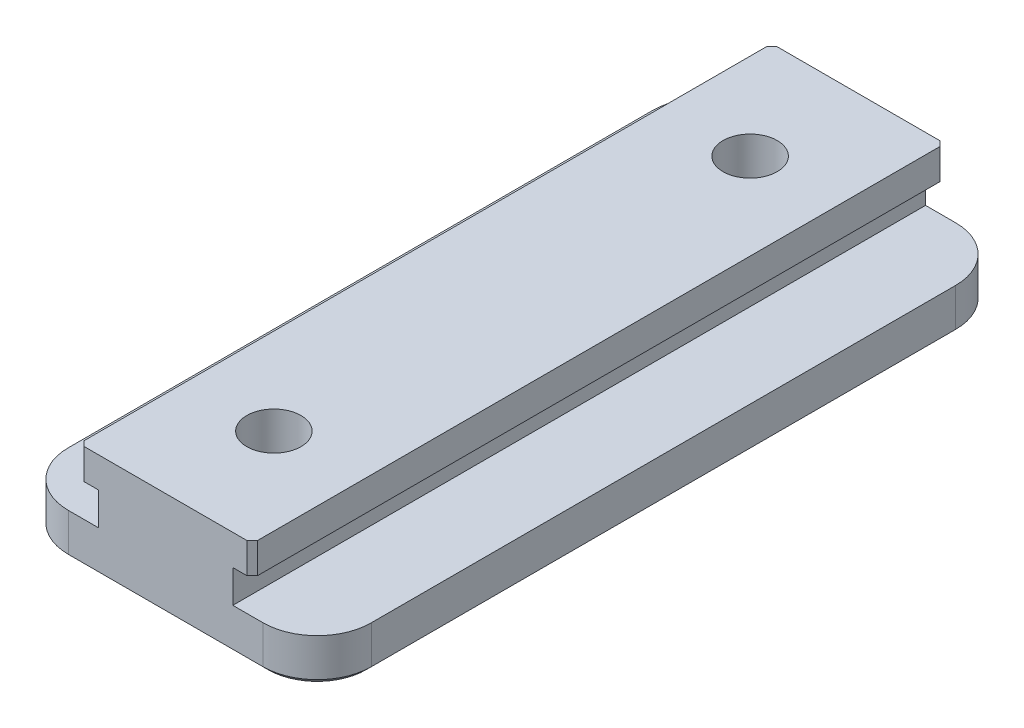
ISO-10303-21;
HEADER;
FILE_DESCRIPTION(('STEP AP214'),'2;1');
FILE_NAME('part.step','',(''),(''),'','','');
FILE_SCHEMA(('AUTOMOTIVE_DESIGN { 1 0 10303 214 1 1 1 1 }'));
ENDSEC;
DATA;
#1=APPLICATION_CONTEXT('core data for automotive mechanical design processes');
#2=APPLICATION_PROTOCOL_DEFINITION('international standard','automotive_design',2000,#1);
#3=PRODUCT_CONTEXT('',#1,'mechanical');
#4=PRODUCT('Part','Part','',(#3));
#5=PRODUCT_RELATED_PRODUCT_CATEGORY('part','',(#4));
#6=PRODUCT_DEFINITION_FORMATION('','',#4);
#7=PRODUCT_DEFINITION_CONTEXT('part definition',#1,'design');
#8=PRODUCT_DEFINITION('design','',#6,#7);
#9=PRODUCT_DEFINITION_SHAPE('','',#8);
#10=(LENGTH_UNIT() NAMED_UNIT(*) SI_UNIT(.MILLI.,.METRE.));
#11=(NAMED_UNIT(*) PLANE_ANGLE_UNIT() SI_UNIT($,.RADIAN.));
#12=(NAMED_UNIT(*) SI_UNIT($,.STERADIAN.) SOLID_ANGLE_UNIT());
#13=UNCERTAINTY_MEASURE_WITH_UNIT(LENGTH_MEASURE(1.E-05),#10,'distance_accuracy_value','');
#14=(GEOMETRIC_REPRESENTATION_CONTEXT(3) GLOBAL_UNCERTAINTY_ASSIGNED_CONTEXT((#13)) GLOBAL_UNIT_ASSIGNED_CONTEXT((#10,
#11,#12)) REPRESENTATION_CONTEXT('',''));
#15=CARTESIAN_POINT('',(0.,0.,0.));
#16=DIRECTION('',(0.,0.,1.));
#17=DIRECTION('',(1.,0.,0.));
#18=AXIS2_PLACEMENT_3D('',#15,#16,#17);
#19=CARTESIAN_POINT('',(-22.225,-9.525,50.8));
#20=DIRECTION('',(0.,1.,0.));
#21=DIRECTION('',(0.,0.,1.));
#22=AXIS2_PLACEMENT_3D('',#19,#20,#21);
#23=PLANE('',#22);
#24=CARTESIAN_POINT('',(0.,-9.525,-34.925));
#25=DIRECTION('',(0.,-1.,0.));
#26=DIRECTION('',(0.,0.,-1.));
#27=AXIS2_PLACEMENT_3D('',#24,#25,#26);
#28=CIRCLE('',#27,3.96875);
#29=CARTESIAN_POINT('',(0.,-9.525,-38.89375));
#30=VERTEX_POINT('',#29);
#31=EDGE_CURVE('E836',#30,#30,#28,.T.);
#32=ORIENTED_EDGE('',*,*,#31,.F.);
#33=EDGE_LOOP('',(#32));
#34=FACE_BOUND('',#33,.T.);
#35=CARTESIAN_POINT('',(-14.2748,-9.525,-42.8498));
#36=DIRECTION('',(0.,1.,0.));
#37=DIRECTION('',(0.,0.,1.));
#38=AXIS2_PLACEMENT_3D('',#35,#36,#37);
#39=CIRCLE('',#38,7.18819999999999);
#40=CARTESIAN_POINT('',(-21.463,-9.525,-42.8498));
#41=VERTEX_POINT('',#40);
#42=CARTESIAN_POINT('',(-14.2748,-9.525,-50.038));
#43=VERTEX_POINT('',#42);
#44=EDGE_CURVE('E318',#41,#43,#39,.F.);
#45=ORIENTED_EDGE('',*,*,#44,.T.);
#46=DIRECTION('',(1.,0.,0.));
#47=VECTOR('',#46,1.);
#48=CARTESIAN_POINT('',(-22.225,-9.525,-50.038));
#49=LINE('',#48,#47);
#50=CARTESIAN_POINT('',(14.2748,-9.525,-50.038));
#51=VERTEX_POINT('',#50);
#52=EDGE_CURVE('E320',#43,#51,#49,.T.);
#53=ORIENTED_EDGE('',*,*,#52,.T.);
#54=CARTESIAN_POINT('',(14.2748,-9.525,-42.8498));
#55=DIRECTION('',(0.,1.,0.));
#56=DIRECTION('',(0.,0.,1.));
#57=AXIS2_PLACEMENT_3D('',#54,#55,#56);
#58=CIRCLE('',#57,7.18819999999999);
#59=CARTESIAN_POINT('',(21.463,-9.525,-42.8498));
#60=VERTEX_POINT('',#59);
#61=EDGE_CURVE('E316',#51,#60,#58,.F.);
#62=ORIENTED_EDGE('',*,*,#61,.T.);
#63=DIRECTION('',(0.,0.,1.));
#64=VECTOR('',#63,1.);
#65=CARTESIAN_POINT('',(21.463,-9.525,50.8));
#66=LINE('',#65,#64);
#67=CARTESIAN_POINT('',(21.463,-9.525,42.8498));
#68=VERTEX_POINT('',#67);
#69=EDGE_CURVE('E312',#60,#68,#66,.T.);
#70=ORIENTED_EDGE('',*,*,#69,.T.);
#71=CARTESIAN_POINT('',(14.2748,-9.525,42.8498));
#72=DIRECTION('',(0.,1.,0.));
#73=DIRECTION('',(0.,0.,1.));
#74=AXIS2_PLACEMENT_3D('',#71,#72,#73);
#75=CIRCLE('',#74,7.18819999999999);
#76=CARTESIAN_POINT('',(14.2748,-9.525,50.038));
#77=VERTEX_POINT('',#76);
#78=EDGE_CURVE('E308',#68,#77,#75,.F.);
#79=ORIENTED_EDGE('',*,*,#78,.T.);
#80=DIRECTION('',(-1.,0.,0.));
#81=VECTOR('',#80,1.);
#82=CARTESIAN_POINT('',(-14.2748,-9.525,50.038));
#83=LINE('',#82,#81);
#84=CARTESIAN_POINT('',(-14.2748,-9.525,50.038));
#85=VERTEX_POINT('',#84);
#86=EDGE_CURVE('E306',#77,#85,#83,.T.);
#87=ORIENTED_EDGE('',*,*,#86,.T.);
#88=CARTESIAN_POINT('',(-14.2748,-9.525,42.8498));
#89=DIRECTION('',(0.,1.,0.));
#90=DIRECTION('',(0.,0.,1.));
#91=AXIS2_PLACEMENT_3D('',#88,#89,#90);
#92=CIRCLE('',#91,7.18819999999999);
#93=CARTESIAN_POINT('',(-21.463,-9.525,42.8498));
#94=VERTEX_POINT('',#93);
#95=EDGE_CURVE('E310',#85,#94,#92,.F.);
#96=ORIENTED_EDGE('',*,*,#95,.T.);
#97=DIRECTION('',(0.,0.,-1.));
#98=VECTOR('',#97,1.);
#99=CARTESIAN_POINT('',(-21.463,-9.525,50.8));
#100=LINE('',#99,#98);
#101=EDGE_CURVE('E314',#94,#41,#100,.T.);
#102=ORIENTED_EDGE('',*,*,#101,.T.);
#103=EDGE_LOOP('',(#45,#53,#62,#70,#79,#87,#96,#102));
#104=FACE_BOUND('',#103,.T.);
#105=CARTESIAN_POINT('',(0.,-9.525,34.925));
#106=DIRECTION('',(0.,-1.,0.));
#107=DIRECTION('',(0.,0.,-1.));
#108=AXIS2_PLACEMENT_3D('',#105,#106,#107);
#109=CIRCLE('',#108,3.96875);
#110=CARTESIAN_POINT('',(0.,-9.525,30.95625));
#111=VERTEX_POINT('',#110);
#112=EDGE_CURVE('E841',#111,#111,#109,.T.);
#113=ORIENTED_EDGE('',*,*,#112,.F.);
#114=EDGE_LOOP('',(#113));
#115=FACE_BOUND('',#114,.T.);
#116=ADVANCED_FACE('F39',(#34,#104,#115),#23,.F.);
#117=CARTESIAN_POINT('',(-12.7,6.096,50.8));
#118=DIRECTION('',(1.,0.,0.));
#119=DIRECTION('',(0.,0.,-1.));
#120=AXIS2_PLACEMENT_3D('',#117,#118,#119);
#121=PLANE('',#120);
#122=DIRECTION('',(0.,0.,-1.));
#123=VECTOR('',#122,1.);
#124=CARTESIAN_POINT('',(-12.7,6.096,50.8));
#125=LINE('',#124,#123);
#126=CARTESIAN_POINT('',(-12.7,6.096,50.038));
#127=VERTEX_POINT('',#126);
#128=CARTESIAN_POINT('',(-12.7,6.096,-50.038));
#129=VERTEX_POINT('',#128);
#130=EDGE_CURVE('E239',#127,#129,#125,.T.);
#131=ORIENTED_EDGE('',*,*,#130,.T.);
#132=DIRECTION('',(0.,-1.,0.));
#133=VECTOR('',#132,1.);
#134=CARTESIAN_POINT('',(-12.7,6.096,-50.038));
#135=LINE('',#134,#133);
#136=CARTESIAN_POINT('',(-12.7,1.6256,-50.038));
#137=VERTEX_POINT('',#136);
#138=EDGE_CURVE('E385',#129,#137,#135,.T.);
#139=ORIENTED_EDGE('',*,*,#138,.T.);
#140=DIRECTION('',(0.,0.,-1.));
#141=VECTOR('',#140,1.);
#142=CARTESIAN_POINT('',(-12.7,1.6256,50.8));
#143=LINE('',#142,#141);
#144=CARTESIAN_POINT('',(-12.7,1.6256,50.038));
#145=VERTEX_POINT('',#144);
#146=EDGE_CURVE('E219',#145,#137,#143,.T.);
#147=ORIENTED_EDGE('',*,*,#146,.F.);
#148=DIRECTION('',(0.,1.,0.));
#149=VECTOR('',#148,1.);
#150=CARTESIAN_POINT('',(-12.7,6.096,50.038));
#151=LINE('',#150,#149);
#152=EDGE_CURVE('E383',#145,#127,#151,.T.);
#153=ORIENTED_EDGE('',*,*,#152,.T.);
#154=EDGE_LOOP('',(#131,#139,#147,#153));
#155=FACE_BOUND('',#154,.T.);
#156=ADVANCED_FACE('F402',(#155),#121,.F.);
#157=CARTESIAN_POINT('',(-12.7,1.6256,50.8));
#158=DIRECTION('',(0.,1.,0.));
#159=DIRECTION('',(-1.,0.,0.));
#160=AXIS2_PLACEMENT_3D('',#157,#158,#159);
#161=PLANE('',#160);
#162=ORIENTED_EDGE('',*,*,#146,.T.);
#163=DIRECTION('',(-0.707106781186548,0.,0.707106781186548));
#164=VECTOR('',#163,1.);
#165=CARTESIAN_POINT('',(-12.7,1.6256,-50.038));
#166=LINE('',#165,#164);
#167=CARTESIAN_POINT('',(-11.938,1.6256,-50.8));
#168=VERTEX_POINT('',#167);
#169=EDGE_CURVE('E61',#137,#168,#166,.F.);
#170=ORIENTED_EDGE('',*,*,#169,.T.);
#171=DIRECTION('',(1.,0.,0.));
#172=VECTOR('',#171,1.);
#173=CARTESIAN_POINT('',(-12.7,1.6256,-50.8));
#174=LINE('',#173,#172);
#175=CARTESIAN_POINT('',(-9.8552,1.6256,-50.8));
#176=VERTEX_POINT('',#175);
#177=EDGE_CURVE('E216',#168,#176,#174,.T.);
#178=ORIENTED_EDGE('',*,*,#177,.T.);
#179=DIRECTION('',(0.,0.,-1.));
#180=VECTOR('',#179,1.);
#181=CARTESIAN_POINT('',(-9.8552,1.6256,50.8));
#182=LINE('',#181,#180);
#183=CARTESIAN_POINT('',(-9.8552,1.6256,50.8));
#184=VERTEX_POINT('',#183);
#185=EDGE_CURVE('E212',#184,#176,#182,.T.);
#186=ORIENTED_EDGE('',*,*,#185,.F.);
#187=DIRECTION('',(1.,0.,0.));
#188=VECTOR('',#187,1.);
#189=CARTESIAN_POINT('',(-12.7,1.6256,50.8));
#190=LINE('',#189,#188);
#191=CARTESIAN_POINT('',(-11.938,1.6256,50.8));
#192=VERTEX_POINT('',#191);
#193=EDGE_CURVE('E200',#192,#184,#190,.T.);
#194=ORIENTED_EDGE('',*,*,#193,.F.);
#195=DIRECTION('',(-0.707106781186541,0.,-0.707106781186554));
#196=VECTOR('',#195,1.);
#197=CARTESIAN_POINT('',(-11.938,1.6256,50.8));
#198=LINE('',#197,#196);
#199=EDGE_CURVE('E54',#192,#145,#198,.T.);
#200=ORIENTED_EDGE('',*,*,#199,.T.);
#201=EDGE_LOOP('',(#162,#170,#178,#186,#194,#200));
#202=FACE_BOUND('',#201,.T.);
#203=ADVANCED_FACE('F214',(#202),#161,.F.);
#204=CARTESIAN_POINT('',(-9.8552,1.6256,50.8));
#205=DIRECTION('',(1.,0.,0.));
#206=DIRECTION('',(0.,1.,0.));
#207=AXIS2_PLACEMENT_3D('',#204,#205,#206);
#208=PLANE('',#207);
#209=DIRECTION('',(0.,-1.,0.));
#210=VECTOR('',#209,1.);
#211=CARTESIAN_POINT('',(-9.8552,1.6256,-50.8));
#212=LINE('',#211,#210);
#213=CARTESIAN_POINT('',(-9.8552,-3.175,-50.8));
#214=VERTEX_POINT('',#213);
#215=EDGE_CURVE('E241',#176,#214,#212,.T.);
#216=ORIENTED_EDGE('',*,*,#215,.T.);
#217=DIRECTION('',(0.,0.,-1.));
#218=VECTOR('',#217,1.);
#219=CARTESIAN_POINT('',(-9.8552,-3.175,50.8));
#220=LINE('',#219,#218);
#221=CARTESIAN_POINT('',(-9.8552,-3.175,50.8));
#222=VERTEX_POINT('',#221);
#223=EDGE_CURVE('E220',#222,#214,#220,.T.);
#224=ORIENTED_EDGE('',*,*,#223,.F.);
#225=DIRECTION('',(0.,-1.,0.));
#226=VECTOR('',#225,1.);
#227=CARTESIAN_POINT('',(-9.8552,1.6256,50.8));
#228=LINE('',#227,#226);
#229=EDGE_CURVE('E206',#184,#222,#228,.T.);
#230=ORIENTED_EDGE('',*,*,#229,.F.);
#231=ORIENTED_EDGE('',*,*,#185,.T.);
#232=EDGE_LOOP('',(#216,#224,#230,#231));
#233=FACE_BOUND('',#232,.T.);
#234=ADVANCED_FACE('F222',(#233),#208,.F.);
#235=CARTESIAN_POINT('',(-9.8552,-3.175,50.8));
#236=DIRECTION('',(0.,-1.,0.));
#237=DIRECTION('',(1.,0.,0.));
#238=AXIS2_PLACEMENT_3D('',#235,#236,#237);
#239=PLANE('',#238);
#240=DIRECTION('',(0.,0.,-1.));
#241=VECTOR('',#240,1.);
#242=CARTESIAN_POINT('',(-22.225,-3.175,50.8));
#243=LINE('',#242,#241);
#244=CARTESIAN_POINT('',(-22.225,-3.175,42.8498));
#245=VERTEX_POINT('',#244);
#246=CARTESIAN_POINT('',(-22.225,-3.175,-42.8498));
#247=VERTEX_POINT('',#246);
#248=EDGE_CURVE('E273',#245,#247,#243,.T.);
#249=ORIENTED_EDGE('',*,*,#248,.F.);
#250=CARTESIAN_POINT('',(-14.2748,-3.175,42.8498));
#251=DIRECTION('',(0.,-1.,0.));
#252=DIRECTION('',(1.,0.,0.));
#253=AXIS2_PLACEMENT_3D('',#250,#251,#252);
#254=CIRCLE('',#253,7.9502);
#255=CARTESIAN_POINT('',(-14.2748,-3.175,50.8));
#256=VERTEX_POINT('',#255);
#257=EDGE_CURVE('E290',#245,#256,#254,.F.);
#258=ORIENTED_EDGE('',*,*,#257,.T.);
#259=DIRECTION('',(-1.,0.,0.));
#260=VECTOR('',#259,1.);
#261=CARTESIAN_POINT('',(-9.8552,-3.175,50.8));
#262=LINE('',#261,#260);
#263=EDGE_CURVE('E225',#222,#256,#262,.T.);
#264=ORIENTED_EDGE('',*,*,#263,.F.);
#265=ORIENTED_EDGE('',*,*,#223,.T.);
#266=DIRECTION('',(-1.,0.,0.));
#267=VECTOR('',#266,1.);
#268=CARTESIAN_POINT('',(-9.8552,-3.175,-50.8));
#269=LINE('',#268,#267);
#270=CARTESIAN_POINT('',(-14.2748,-3.175,-50.8));
#271=VERTEX_POINT('',#270);
#272=EDGE_CURVE('E244',#214,#271,#269,.T.);
#273=ORIENTED_EDGE('',*,*,#272,.T.);
#274=CARTESIAN_POINT('',(-14.2748,-3.175,-42.8498));
#275=DIRECTION('',(0.,-1.,0.));
#276=DIRECTION('',(1.,0.,0.));
#277=AXIS2_PLACEMENT_3D('',#274,#275,#276);
#278=CIRCLE('',#277,7.9502);
#279=EDGE_CURVE('E288',#271,#247,#278,.F.);
#280=ORIENTED_EDGE('',*,*,#279,.T.);
#281=EDGE_LOOP('',(#249,#258,#264,#265,#273,#280));
#282=FACE_BOUND('',#281,.T.);
#283=ADVANCED_FACE('F520',(#282),#239,.F.);
#284=CARTESIAN_POINT('',(-22.225,-3.175,50.8));
#285=DIRECTION('',(1.,0.,0.));
#286=DIRECTION('',(0.,0.,-1.));
#287=AXIS2_PLACEMENT_3D('',#284,#285,#286);
#288=PLANE('',#287);
#289=DIRECTION('',(0.,-1.,0.));
#290=VECTOR('',#289,1.);
#291=CARTESIAN_POINT('',(-22.225,-3.175,-42.8498));
#292=LINE('',#291,#290);
#293=CARTESIAN_POINT('',(-22.225,-8.763,-42.8498));
#294=VERTEX_POINT('',#293);
#295=EDGE_CURVE('E283',#247,#294,#292,.T.);
#296=ORIENTED_EDGE('',*,*,#295,.T.);
#297=DIRECTION('',(0.,0.,1.));
#298=VECTOR('',#297,1.);
#299=CARTESIAN_POINT('',(-22.225,-8.763,50.8));
#300=LINE('',#299,#298);
#301=CARTESIAN_POINT('',(-22.225,-8.763,42.8498));
#302=VERTEX_POINT('',#301);
#303=EDGE_CURVE('E330',#294,#302,#300,.T.);
#304=ORIENTED_EDGE('',*,*,#303,.T.);
#305=DIRECTION('',(0.,-1.,0.));
#306=VECTOR('',#305,1.);
#307=CARTESIAN_POINT('',(-22.225,-3.175,42.8498));
#308=LINE('',#307,#306);
#309=EDGE_CURVE('E286',#302,#245,#308,.F.);
#310=ORIENTED_EDGE('',*,*,#309,.T.);
#311=ORIENTED_EDGE('',*,*,#248,.T.);
#312=EDGE_LOOP('',(#296,#304,#310,#311));
#313=FACE_BOUND('',#312,.T.);
#314=ADVANCED_FACE('F464',(#313),#288,.F.);
#315=CARTESIAN_POINT('',(22.225,-3.175,50.8));
#316=DIRECTION('',(-1.,0.,0.));
#317=DIRECTION('',(0.,0.,1.));
#318=AXIS2_PLACEMENT_3D('',#315,#316,#317);
#319=PLANE('',#318);
#320=DIRECTION('',(0.,1.,0.));
#321=VECTOR('',#320,1.);
#322=CARTESIAN_POINT('',(22.225,-9.525,42.8498));
#323=LINE('',#322,#321);
#324=CARTESIAN_POINT('',(22.225,-3.175,42.8498));
#325=VERTEX_POINT('',#324);
#326=CARTESIAN_POINT('',(22.225,-8.763,42.8498));
#327=VERTEX_POINT('',#326);
#328=EDGE_CURVE('E297',#325,#327,#323,.F.);
#329=ORIENTED_EDGE('',*,*,#328,.T.);
#330=DIRECTION('',(0.,0.,-1.));
#331=VECTOR('',#330,1.);
#332=CARTESIAN_POINT('',(22.225,-8.763,50.8));
#333=LINE('',#332,#331);
#334=CARTESIAN_POINT('',(22.225,-8.763,-42.8498));
#335=VERTEX_POINT('',#334);
#336=EDGE_CURVE('E332',#327,#335,#333,.T.);
#337=ORIENTED_EDGE('',*,*,#336,.T.);
#338=DIRECTION('',(0.,1.,0.));
#339=VECTOR('',#338,1.);
#340=CARTESIAN_POINT('',(22.225,-3.175,-42.8498));
#341=LINE('',#340,#339);
#342=CARTESIAN_POINT('',(22.225,-3.175,-42.8498));
#343=VERTEX_POINT('',#342);
#344=EDGE_CURVE('E300',#335,#343,#341,.T.);
#345=ORIENTED_EDGE('',*,*,#344,.T.);
#346=DIRECTION('',(0.,0.,-1.));
#347=VECTOR('',#346,1.);
#348=CARTESIAN_POINT('',(22.225,-3.175,50.8));
#349=LINE('',#348,#347);
#350=EDGE_CURVE('E270',#325,#343,#349,.T.);
#351=ORIENTED_EDGE('',*,*,#350,.F.);
#352=EDGE_LOOP('',(#329,#337,#345,#351));
#353=FACE_BOUND('',#352,.T.);
#354=ADVANCED_FACE('F496',(#353),#319,.F.);
#355=CARTESIAN_POINT('',(9.8552,-3.175,50.8));
#356=DIRECTION('',(0.,-1.,0.));
#357=DIRECTION('',(1.,0.,0.));
#358=AXIS2_PLACEMENT_3D('',#355,#356,#357);
#359=PLANE('',#358);
#360=ORIENTED_EDGE('',*,*,#350,.T.);
#361=CARTESIAN_POINT('',(14.2748,-3.175,-42.8498));
#362=DIRECTION('',(0.,-1.,0.));
#363=DIRECTION('',(1.,0.,0.));
#364=AXIS2_PLACEMENT_3D('',#361,#362,#363);
#365=CIRCLE('',#364,7.9502);
#366=CARTESIAN_POINT('',(14.2748,-3.175,-50.8));
#367=VERTEX_POINT('',#366);
#368=EDGE_CURVE('E304',#343,#367,#365,.F.);
#369=ORIENTED_EDGE('',*,*,#368,.T.);
#370=DIRECTION('',(-1.,0.,0.));
#371=VECTOR('',#370,1.);
#372=CARTESIAN_POINT('',(9.8552,-3.175,-50.8));
#373=LINE('',#372,#371);
#374=CARTESIAN_POINT('',(9.8552,-3.175,-50.8));
#375=VERTEX_POINT('',#374);
#376=EDGE_CURVE('E247',#367,#375,#373,.T.);
#377=ORIENTED_EDGE('',*,*,#376,.T.);
#378=DIRECTION('',(0.,0.,-1.));
#379=VECTOR('',#378,1.);
#380=CARTESIAN_POINT('',(9.8552,-3.175,50.8));
#381=LINE('',#380,#379);
#382=CARTESIAN_POINT('',(9.8552,-3.175,50.8));
#383=VERTEX_POINT('',#382);
#384=EDGE_CURVE('E267',#383,#375,#381,.T.);
#385=ORIENTED_EDGE('',*,*,#384,.F.);
#386=DIRECTION('',(-1.,0.,0.));
#387=VECTOR('',#386,1.);
#388=CARTESIAN_POINT('',(9.8552,-3.175,50.8));
#389=LINE('',#388,#387);
#390=CARTESIAN_POINT('',(14.2748,-3.175,50.8));
#391=VERTEX_POINT('',#390);
#392=EDGE_CURVE('E227',#391,#383,#389,.T.);
#393=ORIENTED_EDGE('',*,*,#392,.F.);
#394=CARTESIAN_POINT('',(14.2748,-3.175,42.8498));
#395=DIRECTION('',(0.,-1.,0.));
#396=DIRECTION('',(1.,0.,0.));
#397=AXIS2_PLACEMENT_3D('',#394,#395,#396);
#398=CIRCLE('',#397,7.9502);
#399=EDGE_CURVE('E302',#391,#325,#398,.F.);
#400=ORIENTED_EDGE('',*,*,#399,.T.);
#401=EDGE_LOOP('',(#360,#369,#377,#385,#393,#400));
#402=FACE_BOUND('',#401,.T.);
#403=ADVANCED_FACE('F431',(#402),#359,.F.);
#404=CARTESIAN_POINT('',(9.8552,1.6256,50.8));
#405=DIRECTION('',(-1.,0.,0.));
#406=DIRECTION('',(0.,-1.,0.));
#407=AXIS2_PLACEMENT_3D('',#404,#405,#406);
#408=PLANE('',#407);
#409=DIRECTION('',(0.,1.,0.));
#410=VECTOR('',#409,1.);
#411=CARTESIAN_POINT('',(9.8552,1.6256,-50.8));
#412=LINE('',#411,#410);
#413=CARTESIAN_POINT('',(9.8552,1.6256,-50.8));
#414=VERTEX_POINT('',#413);
#415=EDGE_CURVE('E249',#375,#414,#412,.T.);
#416=ORIENTED_EDGE('',*,*,#415,.T.);
#417=DIRECTION('',(0.,0.,-1.));
#418=VECTOR('',#417,1.);
#419=CARTESIAN_POINT('',(9.8552,1.6256,50.8));
#420=LINE('',#419,#418);
#421=CARTESIAN_POINT('',(9.8552,1.6256,50.8));
#422=VERTEX_POINT('',#421);
#423=EDGE_CURVE('E264',#422,#414,#420,.T.);
#424=ORIENTED_EDGE('',*,*,#423,.F.);
#425=DIRECTION('',(0.,1.,0.));
#426=VECTOR('',#425,1.);
#427=CARTESIAN_POINT('',(9.8552,1.6256,50.8));
#428=LINE('',#427,#426);
#429=EDGE_CURVE('E232',#383,#422,#428,.T.);
#430=ORIENTED_EDGE('',*,*,#429,.F.);
#431=ORIENTED_EDGE('',*,*,#384,.T.);
#432=EDGE_LOOP('',(#416,#424,#430,#431));
#433=FACE_BOUND('',#432,.T.);
#434=ADVANCED_FACE('F427',(#433),#408,.F.);
#435=CARTESIAN_POINT('',(12.7,1.6256,50.8));
#436=DIRECTION('',(0.,1.,0.));
#437=DIRECTION('',(0.,0.,1.));
#438=AXIS2_PLACEMENT_3D('',#435,#436,#437);
#439=PLANE('',#438);
#440=DIRECTION('',(1.,0.,0.));
#441=VECTOR('',#440,1.);
#442=CARTESIAN_POINT('',(12.7,1.6256,-50.8));
#443=LINE('',#442,#441);
#444=CARTESIAN_POINT('',(11.938,1.6256,-50.8));
#445=VERTEX_POINT('',#444);
#446=EDGE_CURVE('E251',#414,#445,#443,.T.);
#447=ORIENTED_EDGE('',*,*,#446,.T.);
#448=DIRECTION('',(-0.707106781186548,0.,-0.707106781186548));
#449=VECTOR('',#448,1.);
#450=CARTESIAN_POINT('',(12.7,1.6256,-50.038));
#451=LINE('',#450,#449);
#452=CARTESIAN_POINT('',(12.7,1.6256,-50.038));
#453=VERTEX_POINT('',#452);
#454=EDGE_CURVE('E381',#445,#453,#451,.F.);
#455=ORIENTED_EDGE('',*,*,#454,.T.);
#456=DIRECTION('',(0.,0.,-1.));
#457=VECTOR('',#456,1.);
#458=CARTESIAN_POINT('',(12.7,1.6256,50.8));
#459=LINE('',#458,#457);
#460=CARTESIAN_POINT('',(12.7,1.6256,50.038));
#461=VERTEX_POINT('',#460);
#462=EDGE_CURVE('E261',#461,#453,#459,.T.);
#463=ORIENTED_EDGE('',*,*,#462,.F.);
#464=DIRECTION('',(-0.707106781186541,0.,0.707106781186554));
#465=VECTOR('',#464,1.);
#466=CARTESIAN_POINT('',(11.938,1.6256,50.8));
#467=LINE('',#466,#465);
#468=CARTESIAN_POINT('',(11.938,1.6256,50.8));
#469=VERTEX_POINT('',#468);
#470=EDGE_CURVE('E379',#461,#469,#467,.T.);
#471=ORIENTED_EDGE('',*,*,#470,.T.);
#472=DIRECTION('',(1.,0.,0.));
#473=VECTOR('',#472,1.);
#474=CARTESIAN_POINT('',(12.7,1.6256,50.8));
#475=LINE('',#474,#473);
#476=EDGE_CURVE('E234',#422,#469,#475,.T.);
#477=ORIENTED_EDGE('',*,*,#476,.F.);
#478=ORIENTED_EDGE('',*,*,#423,.T.);
#479=EDGE_LOOP('',(#447,#455,#463,#471,#477,#478));
#480=FACE_BOUND('',#479,.T.);
#481=ADVANCED_FACE('F417',(#480),#439,.F.);
#482=CARTESIAN_POINT('',(12.7,6.096,50.8));
#483=DIRECTION('',(-1.,0.,0.));
#484=DIRECTION('',(0.,0.,1.));
#485=AXIS2_PLACEMENT_3D('',#482,#483,#484);
#486=PLANE('',#485);
#487=ORIENTED_EDGE('',*,*,#462,.T.);
#488=DIRECTION('',(0.,1.,0.));
#489=VECTOR('',#488,1.);
#490=CARTESIAN_POINT('',(12.7,6.096,-50.038));
#491=LINE('',#490,#489);
#492=CARTESIAN_POINT('',(12.7,6.096,-50.038));
#493=VERTEX_POINT('',#492);
#494=EDGE_CURVE('E364',#453,#493,#491,.T.);
#495=ORIENTED_EDGE('',*,*,#494,.T.);
#496=DIRECTION('',(0.,0.,-1.));
#497=VECTOR('',#496,1.);
#498=CARTESIAN_POINT('',(12.7,6.096,50.8));
#499=LINE('',#498,#497);
#500=CARTESIAN_POINT('',(12.7,6.096,50.038));
#501=VERTEX_POINT('',#500);
#502=EDGE_CURVE('E258',#501,#493,#499,.T.);
#503=ORIENTED_EDGE('',*,*,#502,.F.);
#504=DIRECTION('',(0.,-1.,0.));
#505=VECTOR('',#504,1.);
#506=CARTESIAN_POINT('',(12.7,1.6256,50.038));
#507=LINE('',#506,#505);
#508=EDGE_CURVE('E340',#501,#461,#507,.T.);
#509=ORIENTED_EDGE('',*,*,#508,.T.);
#510=EDGE_LOOP('',(#487,#495,#503,#509));
#511=FACE_BOUND('',#510,.T.);
#512=ADVANCED_FACE('F419',(#511),#486,.F.);
#513=CARTESIAN_POINT('',(12.7,6.096,50.8));
#514=DIRECTION('',(0.,-1.,0.));
#515=DIRECTION('',(0.,0.,-1.));
#516=AXIS2_PLACEMENT_3D('',#513,#514,#515);
#517=PLANE('',#516);
#518=CARTESIAN_POINT('',(0.,6.096,34.925));
#519=DIRECTION('',(0.,-1.,0.));
#520=DIRECTION('',(0.,0.,-1.));
#521=AXIS2_PLACEMENT_3D('',#518,#519,#520);
#522=CIRCLE('',#521,3.96875);
#523=CARTESIAN_POINT('',(0.,6.096,30.95625));
#524=VERTEX_POINT('',#523);
#525=EDGE_CURVE('E833',#524,#524,#522,.T.);
#526=ORIENTED_EDGE('',*,*,#525,.T.);
#527=EDGE_LOOP('',(#526));
#528=FACE_BOUND('',#527,.T.);
#529=CARTESIAN_POINT('',(0.,6.096,-34.925));
#530=DIRECTION('',(0.,-1.,0.));
#531=DIRECTION('',(0.,0.,-1.));
#532=AXIS2_PLACEMENT_3D('',#529,#530,#531);
#533=CIRCLE('',#532,3.96875);
#534=CARTESIAN_POINT('',(0.,6.096,-38.89375));
#535=VERTEX_POINT('',#534);
#536=EDGE_CURVE('E344',#535,#535,#533,.T.);
#537=ORIENTED_EDGE('',*,*,#536,.T.);
#538=EDGE_LOOP('',(#537));
#539=FACE_BOUND('',#538,.T.);
#540=ORIENTED_EDGE('',*,*,#502,.T.);
#541=DIRECTION('',(0.707106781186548,0.,0.707106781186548));
#542=VECTOR('',#541,1.);
#543=CARTESIAN_POINT('',(12.7,6.096,-50.038));
#544=LINE('',#543,#542);
#545=CARTESIAN_POINT('',(11.938,6.096,-50.8));
#546=VERTEX_POINT('',#545);
#547=EDGE_CURVE('E373',#493,#546,#544,.F.);
#548=ORIENTED_EDGE('',*,*,#547,.T.);
#549=DIRECTION('',(-1.,0.,0.));
#550=VECTOR('',#549,1.);
#551=CARTESIAN_POINT('',(12.7,6.096,-50.8));
#552=LINE('',#551,#550);
#553=CARTESIAN_POINT('',(-11.938,6.096,-50.8));
#554=VERTEX_POINT('',#553);
#555=EDGE_CURVE('E209',#546,#554,#552,.T.);
#556=ORIENTED_EDGE('',*,*,#555,.T.);
#557=DIRECTION('',(0.707106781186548,0.,-0.707106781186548));
#558=VECTOR('',#557,1.);
#559=CARTESIAN_POINT('',(-12.7,6.096,-50.038));
#560=LINE('',#559,#558);
#561=EDGE_CURVE('E371',#554,#129,#560,.F.);
#562=ORIENTED_EDGE('',*,*,#561,.T.);
#563=ORIENTED_EDGE('',*,*,#130,.F.);
#564=DIRECTION('',(0.707106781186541,0.,0.707106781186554));
#565=VECTOR('',#564,1.);
#566=CARTESIAN_POINT('',(-11.938,6.096,50.8));
#567=LINE('',#566,#565);
#568=CARTESIAN_POINT('',(-11.938,6.096,50.8));
#569=VERTEX_POINT('',#568);
#570=EDGE_CURVE('E369',#127,#569,#567,.T.);
#571=ORIENTED_EDGE('',*,*,#570,.T.);
#572=DIRECTION('',(-1.,0.,0.));
#573=VECTOR('',#572,1.);
#574=CARTESIAN_POINT('',(12.7,6.096,50.8));
#575=LINE('',#574,#573);
#576=CARTESIAN_POINT('',(11.938,6.096,50.8));
#577=VERTEX_POINT('',#576);
#578=EDGE_CURVE('E237',#577,#569,#575,.T.);
#579=ORIENTED_EDGE('',*,*,#578,.F.);
#580=DIRECTION('',(0.707106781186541,0.,-0.707106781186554));
#581=VECTOR('',#580,1.);
#582=CARTESIAN_POINT('',(11.938,6.096,50.8));
#583=LINE('',#582,#581);
#584=EDGE_CURVE('E367',#577,#501,#583,.T.);
#585=ORIENTED_EDGE('',*,*,#584,.T.);
#586=EDGE_LOOP('',(#540,#548,#556,#562,#563,#571,#579,#585));
#587=FACE_BOUND('',#586,.T.);
#588=ADVANCED_FACE('F395',(#528,#539,#587),#517,.F.);
#589=CARTESIAN_POINT('',(0.,0.,50.8));
#590=DIRECTION('',(0.,0.,1.));
#591=DIRECTION('',(1.,0.,0.));
#592=AXIS2_PLACEMENT_3D('',#589,#590,#591);
#593=PLANE('',#592);
#594=ORIENTED_EDGE('',*,*,#578,.T.);
#595=DIRECTION('',(0.,-1.,0.));
#596=VECTOR('',#595,1.);
#597=CARTESIAN_POINT('',(-11.938,1.6256,50.8));
#598=LINE('',#597,#596);
#599=EDGE_CURVE('E11',#569,#192,#598,.T.);
#600=ORIENTED_EDGE('',*,*,#599,.T.);
#601=ORIENTED_EDGE('',*,*,#193,.T.);
#602=ORIENTED_EDGE('',*,*,#229,.T.);
#603=ORIENTED_EDGE('',*,*,#263,.T.);
#604=DIRECTION('',(0.,-1.,0.));
#605=VECTOR('',#604,1.);
#606=CARTESIAN_POINT('',(-14.2748,-9.525,50.8));
#607=LINE('',#606,#605);
#608=CARTESIAN_POINT('',(-14.2748,-8.763,50.8));
#609=VERTEX_POINT('',#608);
#610=EDGE_CURVE('E280',#256,#609,#607,.T.);
#611=ORIENTED_EDGE('',*,*,#610,.T.);
#612=DIRECTION('',(1.,0.,0.));
#613=VECTOR('',#612,1.);
#614=CARTESIAN_POINT('',(14.2748,-8.763,50.8));
#615=LINE('',#614,#613);
#616=CARTESIAN_POINT('',(14.2748,-8.763,50.8));
#617=VERTEX_POINT('',#616);
#618=EDGE_CURVE('E338',#609,#617,#615,.T.);
#619=ORIENTED_EDGE('',*,*,#618,.T.);
#620=DIRECTION('',(0.,1.,0.));
#621=VECTOR('',#620,1.);
#622=CARTESIAN_POINT('',(14.2748,-3.175,50.8));
#623=LINE('',#622,#621);
#624=EDGE_CURVE('E278',#617,#391,#623,.T.);
#625=ORIENTED_EDGE('',*,*,#624,.T.);
#626=ORIENTED_EDGE('',*,*,#392,.T.);
#627=ORIENTED_EDGE('',*,*,#429,.T.);
#628=ORIENTED_EDGE('',*,*,#476,.T.);
#629=DIRECTION('',(0.,1.,0.));
#630=VECTOR('',#629,1.);
#631=CARTESIAN_POINT('',(11.938,6.096,50.8));
#632=LINE('',#631,#630);
#633=EDGE_CURVE('E47',#469,#577,#632,.T.);
#634=ORIENTED_EDGE('',*,*,#633,.T.);
#635=EDGE_LOOP('',(#594,#600,#601,#602,#603,#611,#619,#625,#626,#627,#628,#634));
#636=FACE_BOUND('',#635,.T.);
#637=ADVANCED_FACE('F203',(#636),#593,.T.);
#638=CARTESIAN_POINT('',(0.,0.,-50.8));
#639=DIRECTION('',(0.,0.,1.));
#640=DIRECTION('',(1.,0.,0.));
#641=AXIS2_PLACEMENT_3D('',#638,#639,#640);
#642=PLANE('',#641);
#643=ORIENTED_EDGE('',*,*,#555,.F.);
#644=DIRECTION('',(0.,-1.,0.));
#645=VECTOR('',#644,1.);
#646=CARTESIAN_POINT('',(11.938,0.,-50.8));
#647=LINE('',#646,#645);
#648=EDGE_CURVE('E377',#546,#445,#647,.T.);
#649=ORIENTED_EDGE('',*,*,#648,.T.);
#650=ORIENTED_EDGE('',*,*,#446,.F.);
#651=ORIENTED_EDGE('',*,*,#415,.F.);
#652=ORIENTED_EDGE('',*,*,#376,.F.);
#653=DIRECTION('',(0.,1.,0.));
#654=VECTOR('',#653,1.);
#655=CARTESIAN_POINT('',(14.2748,0.,-50.8));
#656=LINE('',#655,#654);
#657=CARTESIAN_POINT('',(14.2748,-8.763,-50.8));
#658=VERTEX_POINT('',#657);
#659=EDGE_CURVE('E292',#367,#658,#656,.F.);
#660=ORIENTED_EDGE('',*,*,#659,.T.);
#661=DIRECTION('',(-1.,0.,0.));
#662=VECTOR('',#661,1.);
#663=CARTESIAN_POINT('',(0.,-8.763,-50.8));
#664=LINE('',#663,#662);
#665=CARTESIAN_POINT('',(-14.2748,-8.763,-50.8));
#666=VERTEX_POINT('',#665);
#667=EDGE_CURVE('E323',#658,#666,#664,.T.);
#668=ORIENTED_EDGE('',*,*,#667,.T.);
#669=DIRECTION('',(0.,-1.,0.));
#670=VECTOR('',#669,1.);
#671=CARTESIAN_POINT('',(-14.2748,0.,-50.8));
#672=LINE('',#671,#670);
#673=EDGE_CURVE('E295',#666,#271,#672,.F.);
#674=ORIENTED_EDGE('',*,*,#673,.T.);
#675=ORIENTED_EDGE('',*,*,#272,.F.);
#676=ORIENTED_EDGE('',*,*,#215,.F.);
#677=ORIENTED_EDGE('',*,*,#177,.F.);
#678=DIRECTION('',(0.,1.,0.));
#679=VECTOR('',#678,1.);
#680=CARTESIAN_POINT('',(-11.938,0.,-50.8));
#681=LINE('',#680,#679);
#682=EDGE_CURVE('E375',#168,#554,#681,.T.);
#683=ORIENTED_EDGE('',*,*,#682,.T.);
#684=EDGE_LOOP('',(#643,#649,#650,#651,#652,#660,#668,#674,#675,#676,#677,#683));
#685=FACE_BOUND('',#684,.T.);
#686=ADVANCED_FACE('F405',(#685),#642,.F.);
#687=CARTESIAN_POINT('',(-14.2748,0.,42.8498));
#688=DIRECTION('',(0.,1.,0.));
#689=DIRECTION('',(0.,0.,1.));
#690=AXIS2_PLACEMENT_3D('',#687,#688,#689);
#691=CYLINDRICAL_SURFACE('',#690,7.9502);
#692=ORIENTED_EDGE('',*,*,#309,.F.);
#693=CARTESIAN_POINT('',(-14.2748,-8.763,42.8498));
#694=DIRECTION('',(0.,1.,0.));
#695=DIRECTION('',(0.,0.,1.));
#696=AXIS2_PLACEMENT_3D('',#693,#694,#695);
#697=CIRCLE('',#696,7.9502);
#698=EDGE_CURVE('E334',#302,#609,#697,.T.);
#699=ORIENTED_EDGE('',*,*,#698,.T.);
#700=ORIENTED_EDGE('',*,*,#610,.F.);
#701=ORIENTED_EDGE('',*,*,#257,.F.);
#702=EDGE_LOOP('',(#692,#699,#700,#701));
#703=FACE_BOUND('',#702,.T.);
#704=ADVANCED_FACE('F477',(#703),#691,.T.);
#705=CARTESIAN_POINT('',(-14.2748,-3.175,-42.8498));
#706=DIRECTION('',(0.,-1.,0.));
#707=DIRECTION('',(0.,0.,-1.));
#708=AXIS2_PLACEMENT_3D('',#705,#706,#707);
#709=CYLINDRICAL_SURFACE('',#708,7.9502);
#710=ORIENTED_EDGE('',*,*,#673,.F.);
#711=CARTESIAN_POINT('',(-14.2748,-8.763,-42.8498));
#712=DIRECTION('',(0.,1.,0.));
#713=DIRECTION('',(0.,0.,1.));
#714=AXIS2_PLACEMENT_3D('',#711,#712,#713);
#715=CIRCLE('',#714,7.9502);
#716=EDGE_CURVE('E326',#666,#294,#715,.T.);
#717=ORIENTED_EDGE('',*,*,#716,.T.);
#718=ORIENTED_EDGE('',*,*,#295,.F.);
#719=ORIENTED_EDGE('',*,*,#279,.F.);
#720=EDGE_LOOP('',(#710,#717,#718,#719));
#721=FACE_BOUND('',#720,.T.);
#722=ADVANCED_FACE('F460',(#721),#709,.T.);
#723=CARTESIAN_POINT('',(14.2748,-3.175,-42.8498));
#724=DIRECTION('',(0.,1.,0.));
#725=DIRECTION('',(0.,0.,1.));
#726=AXIS2_PLACEMENT_3D('',#723,#724,#725);
#727=CYLINDRICAL_SURFACE('',#726,7.9502);
#728=ORIENTED_EDGE('',*,*,#344,.F.);
#729=CARTESIAN_POINT('',(14.2748,-8.763,-42.8498));
#730=DIRECTION('',(0.,1.,0.));
#731=DIRECTION('',(0.,0.,1.));
#732=AXIS2_PLACEMENT_3D('',#729,#730,#731);
#733=CIRCLE('',#732,7.9502);
#734=EDGE_CURVE('E328',#335,#658,#733,.T.);
#735=ORIENTED_EDGE('',*,*,#734,.T.);
#736=ORIENTED_EDGE('',*,*,#659,.F.);
#737=ORIENTED_EDGE('',*,*,#368,.F.);
#738=EDGE_LOOP('',(#728,#735,#736,#737));
#739=FACE_BOUND('',#738,.T.);
#740=ADVANCED_FACE('F436',(#739),#727,.T.);
#741=CARTESIAN_POINT('',(14.2748,0.,42.8498));
#742=DIRECTION('',(0.,-1.,0.));
#743=DIRECTION('',(0.,0.,-1.));
#744=AXIS2_PLACEMENT_3D('',#741,#742,#743);
#745=CYLINDRICAL_SURFACE('',#744,7.9502);
#746=ORIENTED_EDGE('',*,*,#624,.F.);
#747=CARTESIAN_POINT('',(14.2748,-8.763,42.8498));
#748=DIRECTION('',(0.,1.,0.));
#749=DIRECTION('',(0.,0.,1.));
#750=AXIS2_PLACEMENT_3D('',#747,#748,#749);
#751=CIRCLE('',#750,7.9502);
#752=EDGE_CURVE('E336',#617,#327,#751,.T.);
#753=ORIENTED_EDGE('',*,*,#752,.T.);
#754=ORIENTED_EDGE('',*,*,#328,.F.);
#755=ORIENTED_EDGE('',*,*,#399,.F.);
#756=EDGE_LOOP('',(#746,#753,#754,#755));
#757=FACE_BOUND('',#756,.T.);
#758=ADVANCED_FACE('F493',(#757),#745,.T.);
#759=CARTESIAN_POINT('',(0.,-8.763,50.8));
#760=DIRECTION('',(0.,-0.707106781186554,0.707106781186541));
#761=DIRECTION('',(-1.,0.,0.));
#762=AXIS2_PLACEMENT_3D('',#759,#760,#761);
#763=PLANE('',#762);
#764=DIRECTION('',(0.,-0.707106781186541,-0.707106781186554));
#765=VECTOR('',#764,1.);
#766=CARTESIAN_POINT('',(14.2748,-8.763,50.8));
#767=LINE('',#766,#765);
#768=EDGE_CURVE('E358',#617,#77,#767,.T.);
#769=ORIENTED_EDGE('',*,*,#768,.F.);
#770=ORIENTED_EDGE('',*,*,#618,.F.);
#771=DIRECTION('',(0.,0.707106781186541,0.707106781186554));
#772=VECTOR('',#771,1.);
#773=CARTESIAN_POINT('',(-14.2748,-9.525,50.038));
#774=LINE('',#773,#772);
#775=EDGE_CURVE('E242',#85,#609,#774,.T.);
#776=ORIENTED_EDGE('',*,*,#775,.F.);
#777=ORIENTED_EDGE('',*,*,#86,.F.);
#778=EDGE_LOOP('',(#769,#770,#776,#777));
#779=FACE_BOUND('',#778,.T.);
#780=ADVANCED_FACE('F483',(#779),#763,.T.);
#781=CARTESIAN_POINT('',(-14.2748,-9.525,42.8498));
#782=DIRECTION('',(0.,1.,0.));
#783=DIRECTION('',(0.,0.,1.));
#784=AXIS2_PLACEMENT_3D('',#781,#782,#783);
#785=CONICAL_SURFACE('',#784,7.18819999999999,0.785398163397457);
#786=ORIENTED_EDGE('',*,*,#775,.T.);
#787=ORIENTED_EDGE('',*,*,#698,.F.);
#788=DIRECTION('',(-0.707106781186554,0.707106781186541,0.));
#789=VECTOR('',#788,1.);
#790=CARTESIAN_POINT('',(-21.463,-9.525,42.8498));
#791=LINE('',#790,#789);
#792=EDGE_CURVE('E355',#94,#302,#791,.T.);
#793=ORIENTED_EDGE('',*,*,#792,.F.);
#794=ORIENTED_EDGE('',*,*,#95,.F.);
#795=EDGE_LOOP('',(#786,#787,#793,#794));
#796=FACE_BOUND('',#795,.T.);
#797=ADVANCED_FACE('F473',(#796),#785,.T.);
#798=CARTESIAN_POINT('',(14.2748,-9.525,42.8498));
#799=DIRECTION('',(0.,1.,0.));
#800=DIRECTION('',(0.,0.,1.));
#801=AXIS2_PLACEMENT_3D('',#798,#799,#800);
#802=CONICAL_SURFACE('',#801,7.18819999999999,0.785398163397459);
#803=ORIENTED_EDGE('',*,*,#768,.T.);
#804=ORIENTED_EDGE('',*,*,#78,.F.);
#805=DIRECTION('',(-0.707106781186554,-0.707106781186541,0.));
#806=VECTOR('',#805,1.);
#807=CARTESIAN_POINT('',(22.225,-8.763,42.8498));
#808=LINE('',#807,#806);
#809=EDGE_CURVE('E352',#327,#68,#808,.T.);
#810=ORIENTED_EDGE('',*,*,#809,.F.);
#811=ORIENTED_EDGE('',*,*,#752,.F.);
#812=EDGE_LOOP('',(#803,#804,#810,#811));
#813=FACE_BOUND('',#812,.T.);
#814=ADVANCED_FACE('F489',(#813),#802,.T.);
#815=CARTESIAN_POINT('',(-21.463,-9.525,50.8));
#816=DIRECTION('',(0.707106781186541,0.707106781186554,0.));
#817=DIRECTION('',(0.,0.,-1.));
#818=AXIS2_PLACEMENT_3D('',#815,#816,#817);
#819=PLANE('',#818);
#820=ORIENTED_EDGE('',*,*,#792,.T.);
#821=ORIENTED_EDGE('',*,*,#303,.F.);
#822=DIRECTION('',(-0.707106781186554,0.707106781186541,0.));
#823=VECTOR('',#822,1.);
#824=CARTESIAN_POINT('',(-21.463,-9.525,-42.8498));
#825=LINE('',#824,#823);
#826=EDGE_CURVE('E349',#41,#294,#825,.T.);
#827=ORIENTED_EDGE('',*,*,#826,.F.);
#828=ORIENTED_EDGE('',*,*,#101,.F.);
#829=EDGE_LOOP('',(#820,#821,#827,#828));
#830=FACE_BOUND('',#829,.T.);
#831=ADVANCED_FACE('F468',(#830),#819,.F.);
#832=CARTESIAN_POINT('',(22.225,-8.763,50.8));
#833=DIRECTION('',(-0.707106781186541,0.707106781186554,0.));
#834=DIRECTION('',(0.,0.,-1.));
#835=AXIS2_PLACEMENT_3D('',#832,#833,#834);
#836=PLANE('',#835);
#837=ORIENTED_EDGE('',*,*,#809,.T.);
#838=ORIENTED_EDGE('',*,*,#69,.F.);
#839=DIRECTION('',(-0.707106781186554,-0.707106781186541,0.));
#840=VECTOR('',#839,1.);
#841=CARTESIAN_POINT('',(22.225,-8.763,-42.8498));
#842=LINE('',#841,#840);
#843=EDGE_CURVE('E346',#335,#60,#842,.T.);
#844=ORIENTED_EDGE('',*,*,#843,.F.);
#845=ORIENTED_EDGE('',*,*,#336,.F.);
#846=EDGE_LOOP('',(#837,#838,#844,#845));
#847=FACE_BOUND('',#846,.T.);
#848=ADVANCED_FACE('F498',(#847),#836,.F.);
#849=CARTESIAN_POINT('',(-14.2748,-9.525,-42.8498));
#850=DIRECTION('',(0.,1.,0.));
#851=DIRECTION('',(0.,0.,1.));
#852=AXIS2_PLACEMENT_3D('',#849,#850,#851);
#853=CONICAL_SURFACE('',#852,7.18819999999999,0.785398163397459);
#854=ORIENTED_EDGE('',*,*,#826,.T.);
#855=ORIENTED_EDGE('',*,*,#716,.F.);
#856=DIRECTION('',(0.,0.707106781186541,-0.707106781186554));
#857=VECTOR('',#856,1.);
#858=CARTESIAN_POINT('',(-14.2748,-9.525,-50.038));
#859=LINE('',#858,#857);
#860=EDGE_CURVE('E343',#43,#666,#859,.T.);
#861=ORIENTED_EDGE('',*,*,#860,.F.);
#862=ORIENTED_EDGE('',*,*,#44,.F.);
#863=EDGE_LOOP('',(#854,#855,#861,#862));
#864=FACE_BOUND('',#863,.T.);
#865=ADVANCED_FACE('F457',(#864),#853,.T.);
#866=CARTESIAN_POINT('',(14.2748,-9.525,-42.8498));
#867=DIRECTION('',(0.,1.,0.));
#868=DIRECTION('',(0.,0.,1.));
#869=AXIS2_PLACEMENT_3D('',#866,#867,#868);
#870=CONICAL_SURFACE('',#869,7.18819999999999,0.785398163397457);
#871=ORIENTED_EDGE('',*,*,#843,.T.);
#872=ORIENTED_EDGE('',*,*,#61,.F.);
#873=DIRECTION('',(0.,-0.707106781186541,0.707106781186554));
#874=VECTOR('',#873,1.);
#875=CARTESIAN_POINT('',(14.2748,-8.763,-50.8));
#876=LINE('',#875,#874);
#877=EDGE_CURVE('E341',#658,#51,#876,.T.);
#878=ORIENTED_EDGE('',*,*,#877,.F.);
#879=ORIENTED_EDGE('',*,*,#734,.F.);
#880=EDGE_LOOP('',(#871,#872,#878,#879));
#881=FACE_BOUND('',#880,.T.);
#882=ADVANCED_FACE('F449',(#881),#870,.T.);
#883=CARTESIAN_POINT('',(-22.225,-9.525,-50.038));
#884=DIRECTION('',(0.,0.707106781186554,0.707106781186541));
#885=DIRECTION('',(1.,0.,0.));
#886=AXIS2_PLACEMENT_3D('',#883,#884,#885);
#887=PLANE('',#886);
#888=ORIENTED_EDGE('',*,*,#860,.T.);
#889=ORIENTED_EDGE('',*,*,#667,.F.);
#890=ORIENTED_EDGE('',*,*,#877,.T.);
#891=ORIENTED_EDGE('',*,*,#52,.F.);
#892=EDGE_LOOP('',(#888,#889,#890,#891));
#893=FACE_BOUND('',#892,.T.);
#894=ADVANCED_FACE('F443',(#893),#887,.F.);
#895=CARTESIAN_POINT('',(12.7,6.096,-50.038));
#896=DIRECTION('',(-0.707106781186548,0.,0.707106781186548));
#897=DIRECTION('',(0.,1.,0.));
#898=AXIS2_PLACEMENT_3D('',#895,#896,#897);
#899=PLANE('',#898);
#900=ORIENTED_EDGE('',*,*,#454,.F.);
#901=ORIENTED_EDGE('',*,*,#648,.F.);
#902=ORIENTED_EDGE('',*,*,#547,.F.);
#903=ORIENTED_EDGE('',*,*,#494,.F.);
#904=EDGE_LOOP('',(#900,#901,#902,#903));
#905=FACE_BOUND('',#904,.T.);
#906=ADVANCED_FACE('F413',(#905),#899,.F.);
#907=CARTESIAN_POINT('',(-12.7,6.096,-50.038));
#908=DIRECTION('',(0.707106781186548,0.,0.707106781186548));
#909=DIRECTION('',(0.,-1.,0.));
#910=AXIS2_PLACEMENT_3D('',#907,#908,#909);
#911=PLANE('',#910);
#912=ORIENTED_EDGE('',*,*,#561,.F.);
#913=ORIENTED_EDGE('',*,*,#682,.F.);
#914=ORIENTED_EDGE('',*,*,#169,.F.);
#915=ORIENTED_EDGE('',*,*,#138,.F.);
#916=EDGE_LOOP('',(#912,#913,#914,#915));
#917=FACE_BOUND('',#916,.T.);
#918=ADVANCED_FACE('F408',(#917),#911,.F.);
#919=CARTESIAN_POINT('',(-11.938,0.,50.8));
#920=DIRECTION('',(-0.707106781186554,0.,0.707106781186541));
#921=DIRECTION('',(0.,1.,0.));
#922=AXIS2_PLACEMENT_3D('',#919,#920,#921);
#923=PLANE('',#922);
#924=ORIENTED_EDGE('',*,*,#570,.F.);
#925=ORIENTED_EDGE('',*,*,#152,.F.);
#926=ORIENTED_EDGE('',*,*,#199,.F.);
#927=ORIENTED_EDGE('',*,*,#599,.F.);
#928=EDGE_LOOP('',(#924,#925,#926,#927));
#929=FACE_BOUND('',#928,.T.);
#930=ADVANCED_FACE('F399',(#929),#923,.T.);
#931=CARTESIAN_POINT('',(11.938,0.,50.8));
#932=DIRECTION('',(0.707106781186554,0.,0.707106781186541));
#933=DIRECTION('',(0.,-1.,0.));
#934=AXIS2_PLACEMENT_3D('',#931,#932,#933);
#935=PLANE('',#934);
#936=ORIENTED_EDGE('',*,*,#470,.F.);
#937=ORIENTED_EDGE('',*,*,#508,.F.);
#938=ORIENTED_EDGE('',*,*,#584,.F.);
#939=ORIENTED_EDGE('',*,*,#633,.F.);
#940=EDGE_LOOP('',(#936,#937,#938,#939));
#941=FACE_BOUND('',#940,.T.);
#942=ADVANCED_FACE('F41',(#941),#935,.T.);
#943=CARTESIAN_POINT('',(0.,-9.525,-34.925));
#944=DIRECTION('',(0.,-1.,0.));
#945=DIRECTION('',(0.,0.,-1.));
#946=AXIS2_PLACEMENT_3D('',#943,#944,#945);
#947=CYLINDRICAL_SURFACE('',#946,3.96875);
#948=ORIENTED_EDGE('',*,*,#536,.F.);
#949=EDGE_LOOP('',(#948));
#950=FACE_BOUND('',#949,.T.);
#951=ORIENTED_EDGE('',*,*,#31,.T.);
#952=EDGE_LOOP('',(#951));
#953=FACE_BOUND('',#952,.T.);
#954=ADVANCED_FACE('F572',(#950,#953),#947,.F.);
#955=CARTESIAN_POINT('',(0.,-9.525,34.925));
#956=DIRECTION('',(0.,-1.,0.));
#957=DIRECTION('',(0.,0.,-1.));
#958=AXIS2_PLACEMENT_3D('',#955,#956,#957);
#959=CYLINDRICAL_SURFACE('',#958,3.96875);
#960=ORIENTED_EDGE('',*,*,#525,.F.);
#961=EDGE_LOOP('',(#960));
#962=FACE_BOUND('',#961,.T.);
#963=ORIENTED_EDGE('',*,*,#112,.T.);
#964=EDGE_LOOP('',(#963));
#965=FACE_BOUND('',#964,.T.);
#966=ADVANCED_FACE('F579',(#962,#965),#959,.F.);
#967=CLOSED_SHELL('',(#116,#156,#203,#234,#283,#314,#354,#403,#434,#481,#512,#588,#637,#686,
#704,#722,#740,#758,#780,#797,#814,#831,#848,#865,#882,#894,#906,#918,#930,#942,#954,#966));
#968=MANIFOLD_SOLID_BREP('B2',#967);
#969=ADVANCED_BREP_SHAPE_REPRESENTATION('',(#18,#968),#14);
#970=SHAPE_DEFINITION_REPRESENTATION(#9,#969);
ENDSEC;
END-ISO-10303-21;
